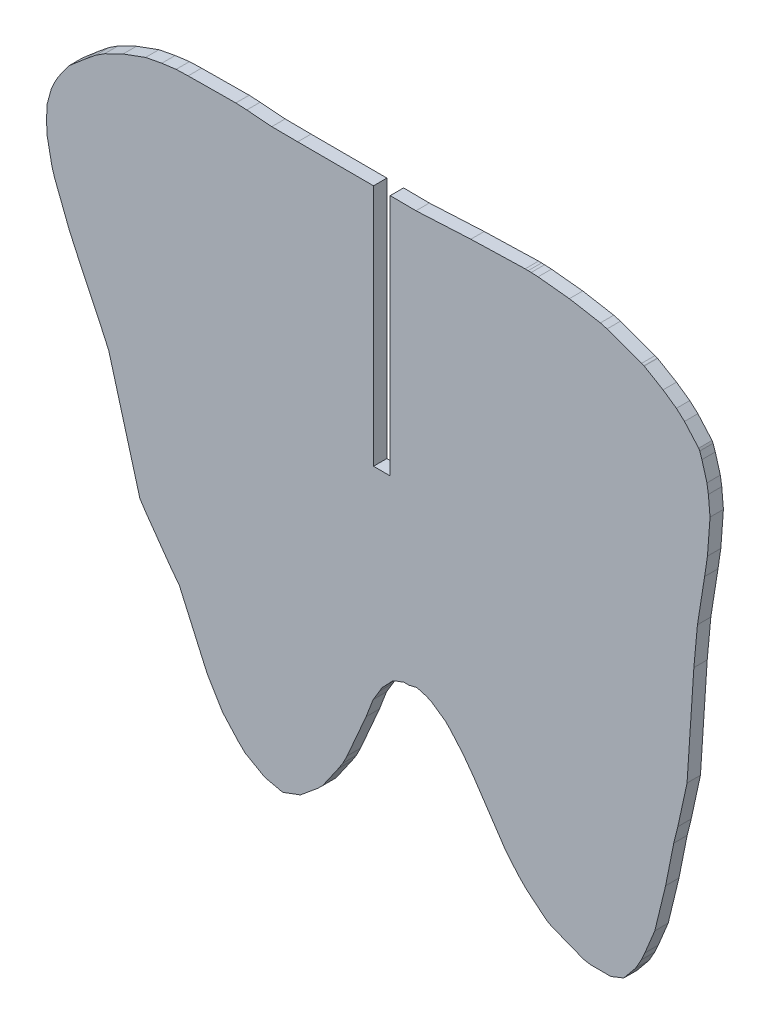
from build123d import *

# Parameters (mm, degrees)
EXTRUDE_1_DEPTH = 2


with BuildPart() as part:
    # Model → Extrude 1 (new body)
    with BuildSketch(Plane.XY):
        Polygon((-5853.0245, 159.3657), (-5855.8444, 161.036), (-5855.8894, 161.0573), (-5856.2394, 161.1905), (-5861.403, 163.0673), (-5862.399, 163.3504), (-5867.0375, 164.1654), (-5871.7121, 164.6539), (-5872.7494, 164.7031), (-5873.195, 164.7166), (-5873.6407, 164.7302), (-5881.7724, 164.4992), (-5889.9709, 164.0833), (-5893.822, 164.1198), (-5893.822, 127.8223), (-5894.072, 127.8223), (-5896.072, 127.8223), (-5896.322, 127.8223), (-5896.322, 164.1412), (-5907.6613, 164.1685), (-5911.5273, 164.1981), (-5915.2686, 164.4894), (-5916.9083, 164.5766), (-5924.0391, 164.5159), (-5925.8358, 164.4639), (-5927.9769, 164.1839), (-5930.4005, 163.7235), (-5933.7527, 162.4948), (-5936.5193, 161.143), (-5937.86, 160.2812), (-5939.4629, 158.9738), (-5941.8194, 156.9559), (-5943.4365, 154.7165), (-5943.9919, 153.7275), (-5944.5191, 152.5181), (-5945.1427, 150.237), (-5945.2005, 148.1909), (-5945.1408, 146.3424), (-5944.3987, 142.6154), (-5944.0117, 141.35), (-5941.7901, 135.6252), (-5940.0094, 131.7446), (-5936.8919, 125.1835), (-5935.9087, 123.0169), (-5931.2545, 106.1937), (-5930.298, 104.7421), (-5926.541, 99.4409), (-5925.3628, 97.9178), (-5924.5741, 96.1359), (-5921.2292, 88.621), (-5921.0174, 88.2528), (-5920.8058, 87.8845), (-5918.8544, 84.6556), (-5916.4716, 82.0192), (-5915.4337, 81.03), (-5915.3044, 80.9686), (-5915.1751, 80.9071), (-5912.6522, 79.463), (-5912.3166, 79.3609), (-5909.9347, 78.8242), (-5909.8882, 78.8308), (-5909.8416, 78.8373), (-5907.2505, 79.8009), (-5904.657, 81.9561), (-5903.9289, 82.6667), (-5901.5328, 86.1057), (-5900.8872, 87.1126), (-5900.266, 88.3421), (-5897.431, 94.8424), (-5896.3836, 97.5712), (-5895.4067, 99.1826), (-5895.0661, 99.7713), (-5893.9303, 100.9517), (-5893.5522, 101.367), (-5893.0344, 101.6905), (-5892.5293, 101.8322), (-5892.1706, 101.9899), (-5891.8119, 102.1476), (-5891.0721, 102.1093), (-5890.4536, 102.2608), (-5889.8352, 102.4124), (-5888.3773, 101.9886), (-5887.596, 101.6126), (-5885.5885, 100.2136), (-5884.8441, 99.4617), (-5882.9702, 97.3084), (-5881.3833, 95.146), (-5876.5685, 87.9604), (-5874.7292, 85.7665), (-5873.4773, 84.4862), (-5870.4433, 81.979), (-5870.2578, 81.8681), (-5870.0722, 81.7573), (-5869.5061, 81.4941), (-5864.8581, 79.6733), (-5864.328, 79.5872), (-5863.7978, 79.5012), (-5863.2833, 79.5045), (-5862.7688, 79.5076), (-5860.8335, 79.5003), (-5858.8993, 80.2709), (-5858.8957, 80.2739), (-5858.8921, 80.2767), (-5857.1284, 82.4362), (-5856.2594, 83.9606), (-5855.7518, 85.0887), (-5854.259, 88.7011), (-5852.6482, 95.3437), (-5851.4267, 101.4708), (-5850.818, 103.9102), (-5849.4389, 110.2574), (-5848.4237, 125.7003), (-5847.8853, 131.5126), (-5846.8141, 138.2993), (-5846.3901, 141.153), (-5846.0045, 146.3994), (-5846.2518, 149.2224), (-5846.4668, 150.6058), (-5847.2173, 153.2288), (-5847.5418, 154.1922), (-5847.7074, 154.4768), (-5849.8239, 156.8854), (-5851.0363, 157.9733), align=None)
    extrude(amount=EXTRUDE_1_DEPTH)


solid = part.part
